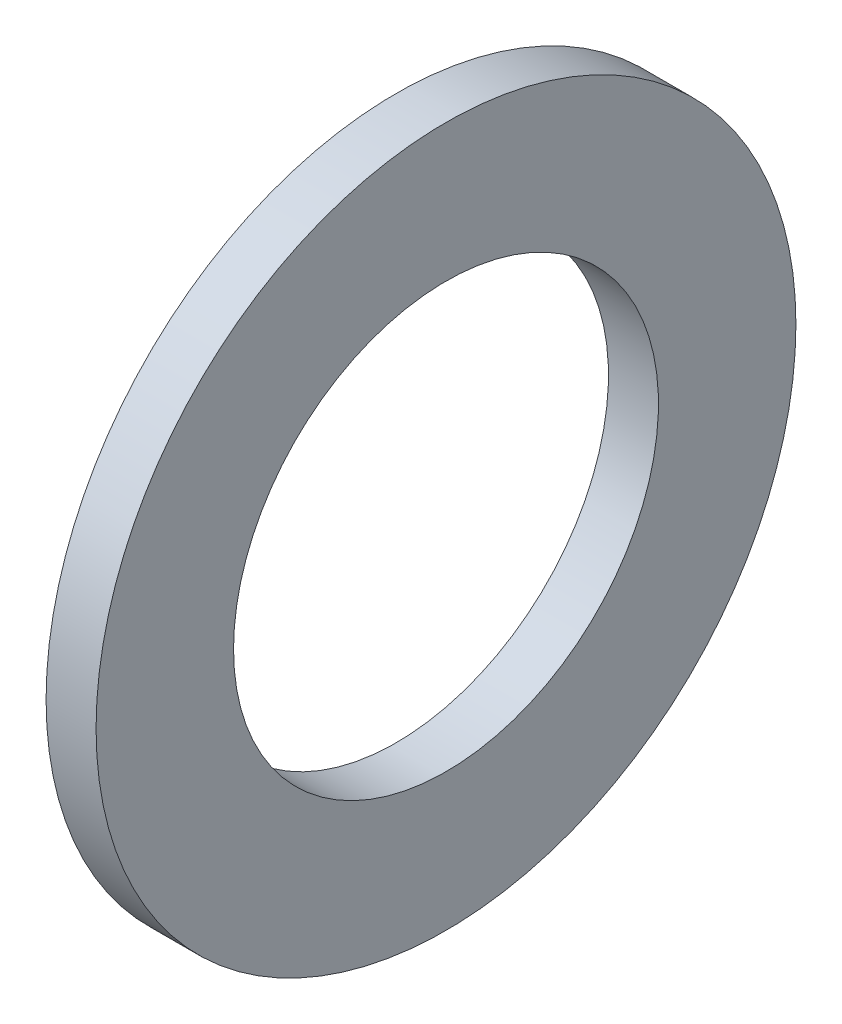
from build123d import *

# Parameters (mm, degrees)
ESQUISSE1_W = 2
ESQUISSE1_H = 5.5


with BuildPart() as part:
    # Esquisse1 → Base-R_volution (revolve)
    with BuildSketch(Plane.XY, mode=Mode.PRIVATE) as base_r_volution_sk:
        with Locations((1, 11.25)):
            Rectangle(ESQUISSE1_W, ESQUISSE1_H)
    revolve(base_r_volution_sk.sketch.rotate(Axis((0, 0, 0), (1, 0, 0)), 90), axis=Axis((0, 0, 0), (1, 0, 0)))


solid = part.part
